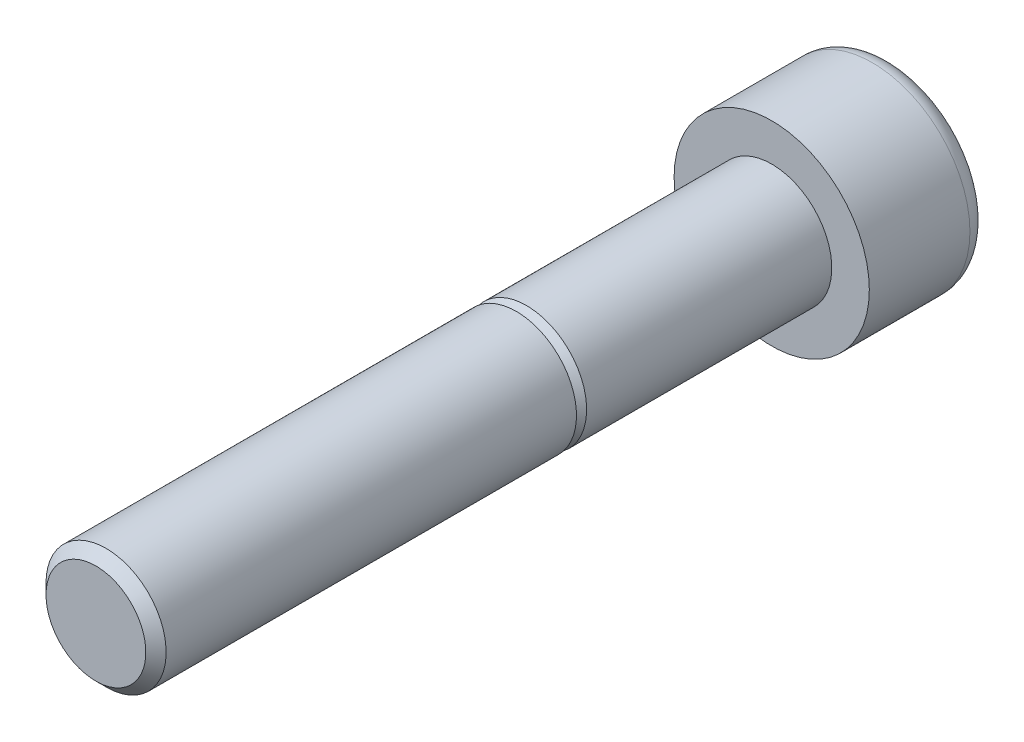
ISO-10303-21;
HEADER;
FILE_DESCRIPTION(('STEP AP214'),'2;1');
FILE_NAME('part.step','',(''),(''),'','','');
FILE_SCHEMA(('AUTOMOTIVE_DESIGN { 1 0 10303 214 1 1 1 1 }'));
ENDSEC;
DATA;
#1=APPLICATION_CONTEXT('core data for automotive mechanical design processes');
#2=APPLICATION_PROTOCOL_DEFINITION('international standard','automotive_design',2000,#1);
#3=PRODUCT_CONTEXT('',#1,'mechanical');
#4=PRODUCT('Part','Part','',(#3));
#5=PRODUCT_RELATED_PRODUCT_CATEGORY('part','',(#4));
#6=PRODUCT_DEFINITION_FORMATION('','',#4);
#7=PRODUCT_DEFINITION_CONTEXT('part definition',#1,'design');
#8=PRODUCT_DEFINITION('design','',#6,#7);
#9=PRODUCT_DEFINITION_SHAPE('','',#8);
#10=(LENGTH_UNIT() NAMED_UNIT(*) SI_UNIT(.MILLI.,.METRE.));
#11=(NAMED_UNIT(*) PLANE_ANGLE_UNIT() SI_UNIT($,.RADIAN.));
#12=(NAMED_UNIT(*) SI_UNIT($,.STERADIAN.) SOLID_ANGLE_UNIT());
#13=UNCERTAINTY_MEASURE_WITH_UNIT(LENGTH_MEASURE(1.E-05),#10,'distance_accuracy_value','');
#14=(GEOMETRIC_REPRESENTATION_CONTEXT(3) GLOBAL_UNCERTAINTY_ASSIGNED_CONTEXT((#13)) GLOBAL_UNIT_ASSIGNED_CONTEXT((#10,
#11,#12)) REPRESENTATION_CONTEXT('',''));
#15=CARTESIAN_POINT('',(0.,0.,0.));
#16=DIRECTION('',(0.,0.,1.));
#17=DIRECTION('',(1.,0.,0.));
#18=AXIS2_PLACEMENT_3D('',#15,#16,#17);
#19=CARTESIAN_POINT('',(0.,0.,0.));
#20=DIRECTION('',(0.,0.,-1.));
#21=DIRECTION('',(-1.,0.,0.));
#22=AXIS2_PLACEMENT_3D('',#19,#20,#21);
#23=PLANE('',#22);
#24=CARTESIAN_POINT('',(0.,0.,0.));
#25=DIRECTION('',(0.,0.,-1.));
#26=DIRECTION('',(-1.,0.,0.));
#27=AXIS2_PLACEMENT_3D('',#24,#25,#26);
#28=CIRCLE('',#27,6.5);
#29=CARTESIAN_POINT('',(-6.5,0.,0.));
#30=VERTEX_POINT('',#29);
#31=EDGE_CURVE('E107',#30,#30,#28,.T.);
#32=ORIENTED_EDGE('',*,*,#31,.F.);
#33=EDGE_LOOP('',(#32));
#34=FACE_BOUND('',#33,.T.);
#35=CARTESIAN_POINT('',(0.,0.,0.));
#36=DIRECTION('',(0.,0.,-1.));
#37=DIRECTION('',(-1.,0.,0.));
#38=AXIS2_PLACEMENT_3D('',#35,#36,#37);
#39=CIRCLE('',#38,4.);
#40=CARTESIAN_POINT('',(-4.,0.,0.));
#41=VERTEX_POINT('',#40);
#42=EDGE_CURVE('E9',#41,#41,#39,.F.);
#43=ORIENTED_EDGE('',*,*,#42,.F.);
#44=EDGE_LOOP('',(#43));
#45=FACE_BOUND('',#44,.T.);
#46=ADVANCED_FACE('F14',(#34,#45),#23,.F.);
#47=CARTESIAN_POINT('',(0.,5.2,-8.));
#48=DIRECTION('',(0.,0.,1.));
#49=DIRECTION('',(1.,0.,0.));
#50=AXIS2_PLACEMENT_3D('',#47,#48,#49);
#51=PLANE('',#50);
#52=CARTESIAN_POINT('',(0.,0.,-8.));
#53=DIRECTION('',(0.,0.,-1.));
#54=DIRECTION('',(-1.,0.,0.));
#55=AXIS2_PLACEMENT_3D('',#52,#53,#54);
#56=CIRCLE('',#55,5.2);
#57=CARTESIAN_POINT('',(-5.2,0.,-8.));
#58=VERTEX_POINT('',#57);
#59=EDGE_CURVE('E89',#58,#58,#56,.T.);
#60=ORIENTED_EDGE('',*,*,#59,.T.);
#61=EDGE_LOOP('',(#60));
#62=FACE_BOUND('',#61,.T.);
#63=DIRECTION('',(-0.866025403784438,0.5,0.));
#64=VECTOR('',#63,1.);
#65=CARTESIAN_POINT('',(-3.75166604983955,-1.29807621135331,-8.));
#66=LINE('',#65,#64);
#67=CARTESIAN_POINT('',(0.,-3.46410161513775,-8.));
#68=VERTEX_POINT('',#67);
#69=CARTESIAN_POINT('',(-3.,-1.73205080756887,-8.));
#70=VERTEX_POINT('',#69);
#71=EDGE_CURVE('E23',#68,#70,#66,.T.);
#72=ORIENTED_EDGE('',*,*,#71,.F.);
#73=DIRECTION('',(-0.866025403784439,-0.5,0.));
#74=VECTOR('',#73,1.);
#75=CARTESIAN_POINT('',(3.75166604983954,-1.29807621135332,-8.));
#76=LINE('',#75,#74);
#77=CARTESIAN_POINT('',(3.,-1.73205080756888,-8.));
#78=VERTEX_POINT('',#77);
#79=EDGE_CURVE('E38',#78,#68,#76,.T.);
#80=ORIENTED_EDGE('',*,*,#79,.F.);
#81=DIRECTION('',(0.,-1.,0.));
#82=VECTOR('',#81,1.);
#83=CARTESIAN_POINT('',(3.,5.2,-8.));
#84=LINE('',#83,#82);
#85=CARTESIAN_POINT('',(3.,1.73205080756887,-8.));
#86=VERTEX_POINT('',#85);
#87=EDGE_CURVE('E120',#86,#78,#84,.T.);
#88=ORIENTED_EDGE('',*,*,#87,.F.);
#89=DIRECTION('',(0.866025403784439,-0.5,0.));
#90=VECTOR('',#89,1.);
#91=CARTESIAN_POINT('',(-0.751666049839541,3.89807621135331,-8.));
#92=LINE('',#91,#90);
#93=CARTESIAN_POINT('',(0.,3.46410161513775,-8.));
#94=VERTEX_POINT('',#93);
#95=EDGE_CURVE('E117',#94,#86,#92,.T.);
#96=ORIENTED_EDGE('',*,*,#95,.F.);
#97=DIRECTION('',(0.866025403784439,0.5,0.));
#98=VECTOR('',#97,1.);
#99=CARTESIAN_POINT('',(0.75166604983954,3.89807621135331,-8.));
#100=LINE('',#99,#98);
#101=CARTESIAN_POINT('',(-3.,1.73205080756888,-8.));
#102=VERTEX_POINT('',#101);
#103=EDGE_CURVE('E114',#102,#94,#100,.T.);
#104=ORIENTED_EDGE('',*,*,#103,.F.);
#105=DIRECTION('',(0.,1.,0.));
#106=VECTOR('',#105,1.);
#107=CARTESIAN_POINT('',(-3.,5.2,-8.));
#108=LINE('',#107,#106);
#109=EDGE_CURVE('E111',#70,#102,#108,.T.);
#110=ORIENTED_EDGE('',*,*,#109,.F.);
#111=EDGE_LOOP('',(#72,#80,#88,#96,#104,#110));
#112=FACE_BOUND('',#111,.T.);
#113=ADVANCED_FACE('F16',(#62,#112),#51,.F.);
#114=CARTESIAN_POINT('',(0.,0.,-8.));
#115=DIRECTION('',(0.,0.,-1.));
#116=DIRECTION('',(-1.,0.,0.));
#117=AXIS2_PLACEMENT_3D('',#114,#115,#116);
#118=CYLINDRICAL_SURFACE('',#117,6.5);
#119=CARTESIAN_POINT('',(0.,0.,-6.7));
#120=DIRECTION('',(0.,0.,-1.));
#121=DIRECTION('',(-1.,0.,0.));
#122=AXIS2_PLACEMENT_3D('',#119,#120,#121);
#123=CIRCLE('',#122,6.5);
#124=CARTESIAN_POINT('',(-6.5,0.,-6.7));
#125=VERTEX_POINT('',#124);
#126=EDGE_CURVE('E97',#125,#125,#123,.T.);
#127=ORIENTED_EDGE('',*,*,#126,.F.);
#128=EDGE_LOOP('',(#127));
#129=FACE_BOUND('',#128,.T.);
#130=ORIENTED_EDGE('',*,*,#31,.T.);
#131=EDGE_LOOP('',(#130));
#132=FACE_BOUND('',#131,.T.);
#133=ADVANCED_FACE('F236',(#129,#132),#118,.T.);
#134=CARTESIAN_POINT('',(0.,0.,-6.7));
#135=DIRECTION('',(0.,0.,-1.));
#136=DIRECTION('',(-1.,0.,0.));
#137=AXIS2_PLACEMENT_3D('',#134,#135,#136);
#138=TOROIDAL_SURFACE('',#137,5.2,1.3);
#139=ORIENTED_EDGE('',*,*,#59,.F.);
#140=EDGE_LOOP('',(#139));
#141=FACE_BOUND('',#140,.T.);
#142=ORIENTED_EDGE('',*,*,#126,.T.);
#143=EDGE_LOOP('',(#142));
#144=FACE_BOUND('',#143,.T.);
#145=ADVANCED_FACE('F243',(#141,#144),#138,.T.);
#146=CARTESIAN_POINT('',(-3.,-1.73205080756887,-4.));
#147=DIRECTION('',(0.5,0.866025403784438,0.));
#148=DIRECTION('',(-0.866025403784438,0.5,0.));
#149=AXIS2_PLACEMENT_3D('',#146,#147,#148);
#150=PLANE('',#149);
#151=ORIENTED_EDGE('',*,*,#71,.T.);
#152=DIRECTION('',(0.,0.,-1.));
#153=VECTOR('',#152,1.);
#154=CARTESIAN_POINT('',(-3.,-1.73205080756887,-4.));
#155=LINE('',#154,#153);
#156=CARTESIAN_POINT('',(-3.,-1.73205080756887,-4.));
#157=VERTEX_POINT('',#156);
#158=EDGE_CURVE('E30',#157,#70,#155,.T.);
#159=ORIENTED_EDGE('',*,*,#158,.F.);
#160=DIRECTION('',(0.866025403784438,-0.5,0.));
#161=VECTOR('',#160,1.);
#162=CARTESIAN_POINT('',(-3.,-1.73205080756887,-4.));
#163=LINE('',#162,#161);
#164=CARTESIAN_POINT('',(0.,-3.46410161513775,-4.));
#165=VERTEX_POINT('',#164);
#166=EDGE_CURVE('E74',#157,#165,#163,.T.);
#167=ORIENTED_EDGE('',*,*,#166,.T.);
#168=DIRECTION('',(0.,0.,-1.));
#169=VECTOR('',#168,1.);
#170=CARTESIAN_POINT('',(0.,-3.46410161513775,-4.));
#171=LINE('',#170,#169);
#172=EDGE_CURVE('E82',#165,#68,#171,.T.);
#173=ORIENTED_EDGE('',*,*,#172,.T.);
#174=EDGE_LOOP('',(#151,#159,#167,#173));
#175=FACE_BOUND('',#174,.T.);
#176=ADVANCED_FACE('F81',(#175),#150,.T.);
#177=CARTESIAN_POINT('',(0.,-3.46410161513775,-4.));
#178=DIRECTION('',(-0.5,0.866025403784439,0.));
#179=DIRECTION('',(-0.866025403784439,-0.5,0.));
#180=AXIS2_PLACEMENT_3D('',#177,#178,#179);
#181=PLANE('',#180);
#182=ORIENTED_EDGE('',*,*,#79,.T.);
#183=ORIENTED_EDGE('',*,*,#172,.F.);
#184=DIRECTION('',(0.866025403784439,0.5,0.));
#185=VECTOR('',#184,1.);
#186=CARTESIAN_POINT('',(0.,-3.46410161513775,-4.));
#187=LINE('',#186,#185);
#188=CARTESIAN_POINT('',(3.,-1.73205080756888,-4.));
#189=VERTEX_POINT('',#188);
#190=EDGE_CURVE('E70',#165,#189,#187,.T.);
#191=ORIENTED_EDGE('',*,*,#190,.T.);
#192=DIRECTION('',(0.,0.,-1.));
#193=VECTOR('',#192,1.);
#194=CARTESIAN_POINT('',(3.,-1.73205080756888,-4.));
#195=LINE('',#194,#193);
#196=EDGE_CURVE('E90',#189,#78,#195,.T.);
#197=ORIENTED_EDGE('',*,*,#196,.T.);
#198=EDGE_LOOP('',(#182,#183,#191,#197));
#199=FACE_BOUND('',#198,.T.);
#200=ADVANCED_FACE('F87',(#199),#181,.T.);
#201=CARTESIAN_POINT('',(3.,-1.73205080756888,-4.));
#202=DIRECTION('',(-1.,0.,0.));
#203=DIRECTION('',(0.,-1.,0.));
#204=AXIS2_PLACEMENT_3D('',#201,#202,#203);
#205=PLANE('',#204);
#206=ORIENTED_EDGE('',*,*,#87,.T.);
#207=ORIENTED_EDGE('',*,*,#196,.F.);
#208=DIRECTION('',(0.,1.,0.));
#209=VECTOR('',#208,1.);
#210=CARTESIAN_POINT('',(3.,-1.73205080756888,-4.));
#211=LINE('',#210,#209);
#212=CARTESIAN_POINT('',(3.,1.73205080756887,-4.));
#213=VERTEX_POINT('',#212);
#214=EDGE_CURVE('E76',#189,#213,#211,.T.);
#215=ORIENTED_EDGE('',*,*,#214,.T.);
#216=DIRECTION('',(0.,0.,-1.));
#217=VECTOR('',#216,1.);
#218=CARTESIAN_POINT('',(3.,1.73205080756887,-4.));
#219=LINE('',#218,#217);
#220=EDGE_CURVE('E100',#213,#86,#219,.T.);
#221=ORIENTED_EDGE('',*,*,#220,.T.);
#222=EDGE_LOOP('',(#206,#207,#215,#221));
#223=FACE_BOUND('',#222,.T.);
#224=ADVANCED_FACE('F159',(#223),#205,.T.);
#225=CARTESIAN_POINT('',(3.,1.73205080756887,-4.));
#226=DIRECTION('',(-0.5,-0.866025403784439,0.));
#227=DIRECTION('',(0.866025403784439,-0.5,0.));
#228=AXIS2_PLACEMENT_3D('',#225,#226,#227);
#229=PLANE('',#228);
#230=ORIENTED_EDGE('',*,*,#95,.T.);
#231=ORIENTED_EDGE('',*,*,#220,.F.);
#232=DIRECTION('',(-0.866025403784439,0.5,0.));
#233=VECTOR('',#232,1.);
#234=CARTESIAN_POINT('',(3.,1.73205080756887,-4.));
#235=LINE('',#234,#233);
#236=CARTESIAN_POINT('',(0.,3.46410161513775,-4.));
#237=VERTEX_POINT('',#236);
#238=EDGE_CURVE('E162',#213,#237,#235,.T.);
#239=ORIENTED_EDGE('',*,*,#238,.T.);
#240=DIRECTION('',(0.,0.,-1.));
#241=VECTOR('',#240,1.);
#242=CARTESIAN_POINT('',(0.,3.46410161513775,-4.));
#243=LINE('',#242,#241);
#244=EDGE_CURVE('E141',#237,#94,#243,.T.);
#245=ORIENTED_EDGE('',*,*,#244,.T.);
#246=EDGE_LOOP('',(#230,#231,#239,#245));
#247=FACE_BOUND('',#246,.T.);
#248=ADVANCED_FACE('F161',(#247),#229,.T.);
#249=CARTESIAN_POINT('',(0.,3.46410161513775,-4.));
#250=DIRECTION('',(0.5,-0.866025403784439,0.));
#251=DIRECTION('',(0.866025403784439,0.5,0.));
#252=AXIS2_PLACEMENT_3D('',#249,#250,#251);
#253=PLANE('',#252);
#254=ORIENTED_EDGE('',*,*,#103,.T.);
#255=ORIENTED_EDGE('',*,*,#244,.F.);
#256=DIRECTION('',(-0.866025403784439,-0.5,0.));
#257=VECTOR('',#256,1.);
#258=CARTESIAN_POINT('',(0.,3.46410161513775,-4.));
#259=LINE('',#258,#257);
#260=CARTESIAN_POINT('',(-3.,1.73205080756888,-4.));
#261=VERTEX_POINT('',#260);
#262=EDGE_CURVE('E139',#237,#261,#259,.T.);
#263=ORIENTED_EDGE('',*,*,#262,.T.);
#264=DIRECTION('',(0.,0.,-1.));
#265=VECTOR('',#264,1.);
#266=CARTESIAN_POINT('',(-3.,1.73205080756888,-4.));
#267=LINE('',#266,#265);
#268=EDGE_CURVE('E133',#261,#102,#267,.T.);
#269=ORIENTED_EDGE('',*,*,#268,.T.);
#270=EDGE_LOOP('',(#254,#255,#263,#269));
#271=FACE_BOUND('',#270,.T.);
#272=ADVANCED_FACE('F135',(#271),#253,.T.);
#273=CARTESIAN_POINT('',(-3.,1.73205080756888,-4.));
#274=DIRECTION('',(1.,0.,0.));
#275=DIRECTION('',(0.,1.,0.));
#276=AXIS2_PLACEMENT_3D('',#273,#274,#275);
#277=PLANE('',#276);
#278=ORIENTED_EDGE('',*,*,#109,.T.);
#279=ORIENTED_EDGE('',*,*,#268,.F.);
#280=DIRECTION('',(0.,-1.,0.));
#281=VECTOR('',#280,1.);
#282=CARTESIAN_POINT('',(-3.,1.73205080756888,-4.));
#283=LINE('',#282,#281);
#284=EDGE_CURVE('E149',#261,#157,#283,.T.);
#285=ORIENTED_EDGE('',*,*,#284,.T.);
#286=ORIENTED_EDGE('',*,*,#158,.T.);
#287=EDGE_LOOP('',(#278,#279,#285,#286));
#288=FACE_BOUND('',#287,.T.);
#289=ADVANCED_FACE('F132',(#288),#277,.T.);
#290=CARTESIAN_POINT('',(0.,-3.46410161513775,-4.));
#291=DIRECTION('',(0.,0.,1.));
#292=DIRECTION('',(-1.,0.,0.));
#293=AXIS2_PLACEMENT_3D('',#290,#291,#292);
#294=PLANE('',#293);
#295=ORIENTED_EDGE('',*,*,#166,.F.);
#296=ORIENTED_EDGE('',*,*,#284,.F.);
#297=ORIENTED_EDGE('',*,*,#262,.F.);
#298=ORIENTED_EDGE('',*,*,#238,.F.);
#299=ORIENTED_EDGE('',*,*,#214,.F.);
#300=ORIENTED_EDGE('',*,*,#190,.F.);
#301=EDGE_LOOP('',(#295,#296,#297,#298,#299,#300));
#302=FACE_BOUND('',#301,.T.);
#303=ADVANCED_FACE('F72',(#302),#294,.F.);
#304=CARTESIAN_POINT('',(0.,0.,0.));
#305=DIRECTION('',(0.,0.,-1.));
#306=DIRECTION('',(-1.,0.,0.));
#307=AXIS2_PLACEMENT_3D('',#304,#305,#306);
#308=CYLINDRICAL_SURFACE('',#307,4.);
#309=CARTESIAN_POINT('',(0.,0.,16.3232169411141));
#310=DIRECTION('',(0.,0.,-1.));
#311=DIRECTION('',(-1.,0.,0.));
#312=AXIS2_PLACEMENT_3D('',#309,#310,#311);
#313=CIRCLE('',#312,4.);
#314=CARTESIAN_POINT('',(-4.,0.,16.3232169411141));
#315=VERTEX_POINT('',#314);
#316=EDGE_CURVE('E187',#315,#315,#313,.T.);
#317=ORIENTED_EDGE('',*,*,#316,.T.);
#318=EDGE_LOOP('',(#317));
#319=FACE_BOUND('',#318,.T.);
#320=ORIENTED_EDGE('',*,*,#42,.T.);
#321=EDGE_LOOP('',(#320));
#322=FACE_BOUND('',#321,.T.);
#323=ADVANCED_FACE('F195',(#319,#322),#308,.T.);
#324=CARTESIAN_POINT('',(0.,0.,45.));
#325=DIRECTION('',(0.,0.,-1.));
#326=DIRECTION('',(-1.,0.,0.));
#327=AXIS2_PLACEMENT_3D('',#324,#325,#326);
#328=PLANE('',#327);
#329=CARTESIAN_POINT('',(0.,0.,45.));
#330=DIRECTION('',(0.,0.,-1.));
#331=DIRECTION('',(-1.,0.,0.));
#332=AXIS2_PLACEMENT_3D('',#329,#330,#331);
#333=CIRCLE('',#332,3.32321694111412);
#334=CARTESIAN_POINT('',(-3.32321694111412,0.,45.));
#335=VERTEX_POINT('',#334);
#336=EDGE_CURVE('E85',#335,#335,#333,.T.);
#337=ORIENTED_EDGE('',*,*,#336,.F.);
#338=EDGE_LOOP('',(#337));
#339=FACE_BOUND('',#338,.T.);
#340=ADVANCED_FACE('F219',(#339),#328,.F.);
#341=CARTESIAN_POINT('',(0.,0.,45.));
#342=DIRECTION('',(0.,0.,-1.));
#343=DIRECTION('',(-1.,0.,0.));
#344=AXIS2_PLACEMENT_3D('',#341,#342,#343);
#345=CONICAL_SURFACE('',#344,3.32321694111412,0.785398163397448);
#346=CARTESIAN_POINT('',(0.,0.,44.3232169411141));
#347=DIRECTION('',(0.,0.,-1.));
#348=DIRECTION('',(-1.,0.,0.));
#349=AXIS2_PLACEMENT_3D('',#346,#347,#348);
#350=CIRCLE('',#349,4.);
#351=CARTESIAN_POINT('',(-4.,0.,44.3232169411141));
#352=VERTEX_POINT('',#351);
#353=EDGE_CURVE('E175',#352,#352,#350,.T.);
#354=ORIENTED_EDGE('',*,*,#353,.F.);
#355=EDGE_LOOP('',(#354));
#356=FACE_BOUND('',#355,.T.);
#357=ORIENTED_EDGE('',*,*,#336,.T.);
#358=EDGE_LOOP('',(#357));
#359=FACE_BOUND('',#358,.T.);
#360=ADVANCED_FACE('F213',(#356,#359),#345,.T.);
#361=CARTESIAN_POINT('',(0.,0.,0.));
#362=DIRECTION('',(0.,0.,-1.));
#363=DIRECTION('',(-1.,0.,0.));
#364=AXIS2_PLACEMENT_3D('',#361,#362,#363);
#365=CYLINDRICAL_SURFACE('',#364,4.);
#366=CARTESIAN_POINT('',(0.,0.,17.));
#367=DIRECTION('',(0.,0.,-1.));
#368=DIRECTION('',(-1.,0.,0.));
#369=AXIS2_PLACEMENT_3D('',#366,#367,#368);
#370=CIRCLE('',#369,4.);
#371=CARTESIAN_POINT('',(-4.,0.,17.));
#372=VERTEX_POINT('',#371);
#373=EDGE_CURVE('E179',#372,#372,#370,.T.);
#374=ORIENTED_EDGE('',*,*,#373,.F.);
#375=EDGE_LOOP('',(#374));
#376=FACE_BOUND('',#375,.T.);
#377=ORIENTED_EDGE('',*,*,#353,.T.);
#378=EDGE_LOOP('',(#377));
#379=FACE_BOUND('',#378,.T.);
#380=ADVANCED_FACE('F207',(#376,#379),#365,.T.);
#381=CARTESIAN_POINT('',(0.,4.,17.));
#382=DIRECTION('',(0.,0.,1.));
#383=DIRECTION('',(1.,0.,0.));
#384=AXIS2_PLACEMENT_3D('',#381,#382,#383);
#385=PLANE('',#384);
#386=CARTESIAN_POINT('',(0.,0.,17.));
#387=DIRECTION('',(0.,0.,-1.));
#388=DIRECTION('',(-1.,0.,0.));
#389=AXIS2_PLACEMENT_3D('',#386,#387,#388);
#390=CIRCLE('',#389,3.32321694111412);
#391=CARTESIAN_POINT('',(-3.32321694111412,0.,17.));
#392=VERTEX_POINT('',#391);
#393=EDGE_CURVE('E183',#392,#392,#390,.T.);
#394=ORIENTED_EDGE('',*,*,#393,.F.);
#395=EDGE_LOOP('',(#394));
#396=FACE_BOUND('',#395,.T.);
#397=ORIENTED_EDGE('',*,*,#373,.T.);
#398=EDGE_LOOP('',(#397));
#399=FACE_BOUND('',#398,.T.);
#400=ADVANCED_FACE('F201',(#396,#399),#385,.F.);
#401=CARTESIAN_POINT('',(0.,0.,17.));
#402=DIRECTION('',(0.,0.,-1.));
#403=DIRECTION('',(-1.,0.,0.));
#404=AXIS2_PLACEMENT_3D('',#401,#402,#403);
#405=CONICAL_SURFACE('',#404,3.32321694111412,0.785398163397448);
#406=ORIENTED_EDGE('',*,*,#316,.F.);
#407=EDGE_LOOP('',(#406));
#408=FACE_BOUND('',#407,.T.);
#409=ORIENTED_EDGE('',*,*,#393,.T.);
#410=EDGE_LOOP('',(#409));
#411=FACE_BOUND('',#410,.T.);
#412=ADVANCED_FACE('F198',(#408,#411),#405,.T.);
#413=CLOSED_SHELL('',(#46,#113,#133,#145,#176,#200,#224,#248,#272,#289,#303,#323,#340,#360,#380,
#400,#412));
#414=MANIFOLD_SOLID_BREP('B1',#413);
#415=ADVANCED_BREP_SHAPE_REPRESENTATION('',(#18,#414),#14);
#416=SHAPE_DEFINITION_REPRESENTATION(#9,#415);
ENDSEC;
END-ISO-10303-21;
